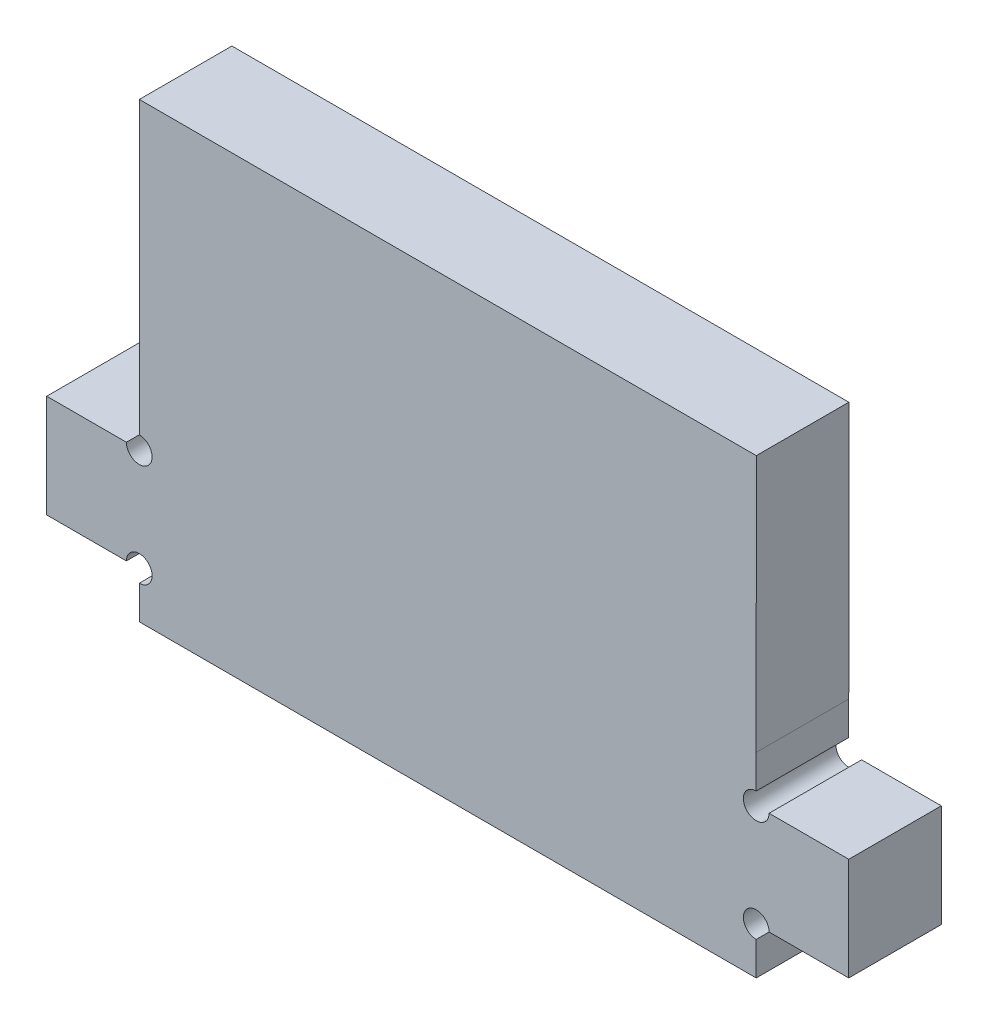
from build123d import *

# Parameters (mm, degrees)
BOSS_EXTRUDE1_DEPTH = 18
BOSS_EXTRUDE2_DEPTH = 18


with BuildPart() as part:
    # Sketch1 → Boss-Extrude1 (new body)
    with BuildSketch(Plane.XY):
        with BuildLine():
            Line((-60, 19), (60, 19))
            Line((60, 19), (60, 12.5))
            ThreePointArc((60, 12.5), (58.232233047, 8.232233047), (62.5, 10))
            Line((62.5, 10), (78, 10))
            Line((78, 10), (78, -10))
            Line((78, -10), (62.5, -10))
            ThreePointArc((62.5, -10), (58.232233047, -8.232233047), (60, -12.5))
            Line((60, -12.5), (60, -19))
            Line((60, -19), (-60, -19))
            Line((-60, -19), (-60, -12.5))
            ThreePointArc((-60, -12.5), (-58.232233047, -8.232233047), (-62.5, -10))
            Line((-62.5, -10), (-78, -10))
            Line((-78, -10), (-78, 10))
            Line((-78, 10), (-62.5, 10))
            ThreePointArc((-62.5, 10), (-58.232233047, 8.232233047), (-60, 12.5))
            Line((-60, 12.5), (-60, 19))
        make_face()
    extrude(amount=BOSS_EXTRUDE1_DEPTH)

    # Sketch2 → Boss-Extrude2 (add)
    with BuildSketch(Plane.XY.offset(18)):
        Polygon((60.017372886, 69), (-59.982627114, 69), (-59.982627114, 19), (0, 19), (60, 19), align=None)
    extrude(amount=-BOSS_EXTRUDE2_DEPTH)


solid = part.part
